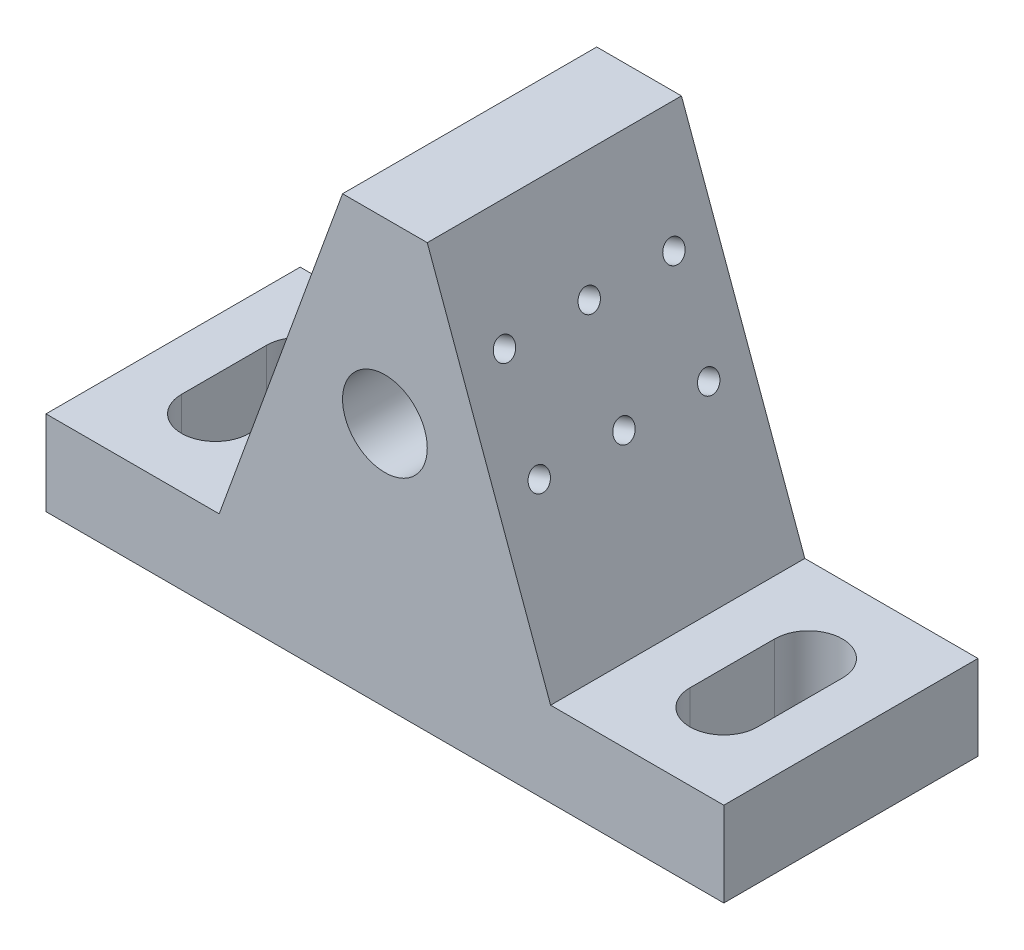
from build123d import *

# Parameters (mm, degrees)
BASE_EXTRUDE_DEPTH   = 15
SLOT_CUT_DEPTH       = 59.523499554
SKETCH3_R            = 5
GUIDE_HOLE_DEPTH     = 71.710678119
LPATTERN1_COUNT      = 3
LPATTERN1_PITCH      = 10
LPATTERN1_COUNT_DIR2 = 2
LPATTERN1_PITCH_DIR2 = 12


with BuildPart() as part:
    # Sketch1 → Base Extrude (new, symmetric)
    with BuildSketch(Plane.XY):
        Polygon((-40, 0), (40, 0), (40, 10), (19.558809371, 10), (5, 50), (-5, 50), (-19.558809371, 10), (-40, 10), align=None)
    extrude(amount=BASE_EXTRUDE_DEPTH, both=True)

    # Sketch2 → Slot Cut (cut, through all)
    with BuildSketch(Plane(origin=(0, 10, 0), x_dir=(1, 0, 0), z_dir=(0, 1, 0))):
        with BuildLine():
            Line((26, -5), (26, 5))
            ThreePointArc((26, 5), (30, 9), (34, 5))
            Line((34, 5), (34, -5))
            ThreePointArc((34, -5), (30, -9), (26, -5))
        make_face()
    slot_cut = extrude(amount=-SLOT_CUT_DEPTH, mode=Mode.SUBTRACT)

    # Mirror1: Slot Cut across plane
    add(slot_cut.mirror(Plane(origin=(0, 0, 0), x_dir=(0, 0, 1), z_dir=(1, 0, 0))), mode=Mode.SUBTRACT)

    # Sketch3 → Guide Hole (cut, through all)
    with BuildSketch(Plane.XY.offset(15)):
        with Locations((0, 29)):
            Circle(SKETCH3_R)
    extrude(amount=-GUIDE_HOLE_DEPTH, mode=Mode.SUBTRACT)

    # Sketch4 → M3x0.5 Tapped Hole1 (revolve, cut)
    with BuildSketch(Plane(origin=(13.216501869, 27.425346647, 10), x_dir=(-0.3420201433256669, 0.9396926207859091, 0), z_dir=(0, 0, 1))):
        Polygon((0, 0), (0, 8.251075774), (1.25, 7.5), (1.25, 0), align=None)
    m3x0_5_tapped_hole1 = revolve(axis=Axis((19.183550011, 29.597174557, 10), (-0.9396926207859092, -0.3420201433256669, 0)), mode=Mode.SUBTRACT)

    # LPattern1: M3x0.5 Tapped Hole1 3 × 2
    with Locations(*[Vector(0, 0, -1) * (i * LPATTERN1_PITCH) + Vector(-0.342020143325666, 0.9396926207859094, 0) * (j * LPATTERN1_PITCH_DIR2) for i in range(LPATTERN1_COUNT) for j in range(LPATTERN1_COUNT_DIR2) if (i, j) != (0, 0)]):
        add(m3x0_5_tapped_hole1, mode=Mode.SUBTRACT)


solid = part.part
